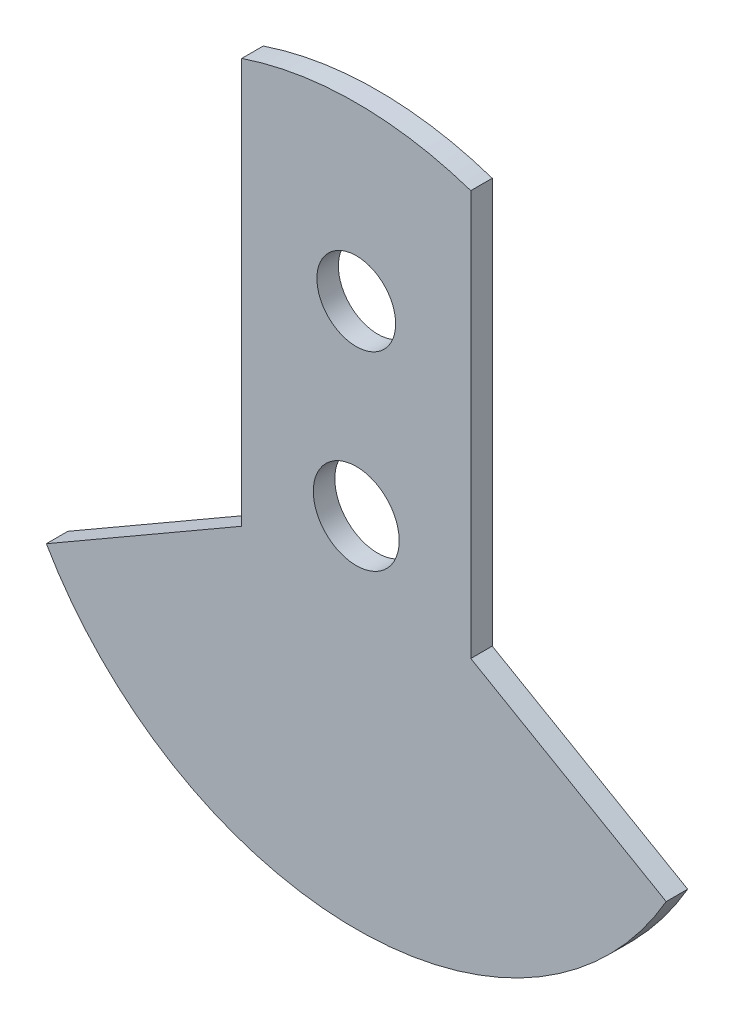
ISO-10303-21;
HEADER;
FILE_DESCRIPTION(('STEP AP214'),'2;1');
FILE_NAME('part.step','',(''),(''),'','','');
FILE_SCHEMA(('AUTOMOTIVE_DESIGN { 1 0 10303 214 1 1 1 1 }'));
ENDSEC;
DATA;
#1=APPLICATION_CONTEXT('core data for automotive mechanical design processes');
#2=APPLICATION_PROTOCOL_DEFINITION('international standard','automotive_design',2000,#1);
#3=PRODUCT_CONTEXT('',#1,'mechanical');
#4=PRODUCT('Part','Part','',(#3));
#5=PRODUCT_RELATED_PRODUCT_CATEGORY('part','',(#4));
#6=PRODUCT_DEFINITION_FORMATION('','',#4);
#7=PRODUCT_DEFINITION_CONTEXT('part definition',#1,'design');
#8=PRODUCT_DEFINITION('design','',#6,#7);
#9=PRODUCT_DEFINITION_SHAPE('','',#8);
#10=(LENGTH_UNIT() NAMED_UNIT(*) SI_UNIT(.MILLI.,.METRE.));
#11=(NAMED_UNIT(*) PLANE_ANGLE_UNIT() SI_UNIT($,.RADIAN.));
#12=(NAMED_UNIT(*) SI_UNIT($,.STERADIAN.) SOLID_ANGLE_UNIT());
#13=UNCERTAINTY_MEASURE_WITH_UNIT(LENGTH_MEASURE(1.E-05),#10,'distance_accuracy_value','');
#14=(GEOMETRIC_REPRESENTATION_CONTEXT(3) GLOBAL_UNCERTAINTY_ASSIGNED_CONTEXT((#13)) GLOBAL_UNIT_ASSIGNED_CONTEXT((#10,
#11,#12)) REPRESENTATION_CONTEXT('',''));
#15=CARTESIAN_POINT('',(0.,0.,0.));
#16=DIRECTION('',(0.,0.,1.));
#17=DIRECTION('',(1.,0.,0.));
#18=AXIS2_PLACEMENT_3D('',#15,#16,#17);
#19=CARTESIAN_POINT('',(0.,0.,1.5));
#20=DIRECTION('',(0.,0.,1.));
#21=DIRECTION('',(1.,0.,0.));
#22=AXIS2_PLACEMENT_3D('',#19,#20,#21);
#23=PLANE('',#22);
#24=CARTESIAN_POINT('',(0.,0.,1.5));
#25=DIRECTION('',(0.,0.,1.));
#26=DIRECTION('',(1.,0.,0.));
#27=AXIS2_PLACEMENT_3D('',#24,#25,#26);
#28=CIRCLE('',#27,3.);
#29=CARTESIAN_POINT('',(3.,0.,1.5));
#30=VERTEX_POINT('',#29);
#31=EDGE_CURVE('E102',#30,#30,#28,.T.);
#32=ORIENTED_EDGE('',*,*,#31,.F.);
#33=EDGE_LOOP('',(#32));
#34=FACE_BOUND('',#33,.T.);
#35=CARTESIAN_POINT('',(0.,0.,1.5));
#36=DIRECTION('',(0.,0.,1.));
#37=DIRECTION('',(1.,0.,0.));
#38=AXIS2_PLACEMENT_3D('',#35,#36,#37);
#39=CIRCLE('',#38,25.);
#40=CARTESIAN_POINT('',(-21.650635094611,-12.5,1.5));
#41=VERTEX_POINT('',#40);
#42=CARTESIAN_POINT('',(21.650635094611,-12.5,1.5));
#43=VERTEX_POINT('',#42);
#44=EDGE_CURVE('E116',#41,#43,#39,.T.);
#45=ORIENTED_EDGE('',*,*,#44,.T.);
#46=DIRECTION('',(-0.866025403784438,0.500000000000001,0.));
#47=VECTOR('',#46,1.);
#48=CARTESIAN_POINT('',(8.,-4.61880215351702,1.5));
#49=LINE('',#48,#47);
#50=CARTESIAN_POINT('',(8.,-4.61880215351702,1.5));
#51=VERTEX_POINT('',#50);
#52=EDGE_CURVE('E97',#43,#51,#49,.T.);
#53=ORIENTED_EDGE('',*,*,#52,.T.);
#54=DIRECTION('',(0.,1.,0.));
#55=VECTOR('',#54,1.);
#56=CARTESIAN_POINT('',(8.,-4.61880215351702,1.5));
#57=LINE('',#56,#55);
#58=CARTESIAN_POINT('',(8.,23.685438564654,1.5));
#59=VERTEX_POINT('',#58);
#60=EDGE_CURVE('E119',#51,#59,#57,.T.);
#61=ORIENTED_EDGE('',*,*,#60,.T.);
#62=CARTESIAN_POINT('',(0.,0.,1.5));
#63=DIRECTION('',(0.,0.,1.));
#64=DIRECTION('',(1.,0.,0.));
#65=AXIS2_PLACEMENT_3D('',#62,#63,#64);
#66=CIRCLE('',#65,25.);
#67=CARTESIAN_POINT('',(-8.,23.685438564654,1.5));
#68=VERTEX_POINT('',#67);
#69=EDGE_CURVE('E121',#59,#68,#66,.T.);
#70=ORIENTED_EDGE('',*,*,#69,.T.);
#71=DIRECTION('',(0.,-1.,0.));
#72=VECTOR('',#71,1.);
#73=CARTESIAN_POINT('',(-8.,-4.61880215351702,1.5));
#74=LINE('',#73,#72);
#75=CARTESIAN_POINT('',(-8.,-4.61880215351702,1.5));
#76=VERTEX_POINT('',#75);
#77=EDGE_CURVE('E50',#68,#76,#74,.T.);
#78=ORIENTED_EDGE('',*,*,#77,.T.);
#79=DIRECTION('',(-0.866025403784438,-0.500000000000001,0.));
#80=VECTOR('',#79,1.);
#81=CARTESIAN_POINT('',(-8.,-4.61880215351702,1.5));
#82=LINE('',#81,#80);
#83=EDGE_CURVE('E45',#76,#41,#82,.T.);
#84=ORIENTED_EDGE('',*,*,#83,.T.);
#85=EDGE_LOOP('',(#45,#53,#61,#70,#78,#84));
#86=FACE_BOUND('',#85,.T.);
#87=CARTESIAN_POINT('',(0.,13.,1.5));
#88=DIRECTION('',(0.,0.,1.));
#89=DIRECTION('',(1.,0.,0.));
#90=AXIS2_PLACEMENT_3D('',#87,#88,#89);
#91=CIRCLE('',#90,2.75);
#92=CARTESIAN_POINT('',(2.75,13.,1.5));
#93=VERTEX_POINT('',#92);
#94=EDGE_CURVE('E176',#93,#93,#91,.T.);
#95=ORIENTED_EDGE('',*,*,#94,.F.);
#96=EDGE_LOOP('',(#95));
#97=FACE_BOUND('',#96,.T.);
#98=ADVANCED_FACE('F30',(#34,#86,#97),#23,.T.);
#99=CARTESIAN_POINT('',(0.,0.,0.));
#100=DIRECTION('',(0.,0.,1.));
#101=DIRECTION('',(1.,0.,0.));
#102=AXIS2_PLACEMENT_3D('',#99,#100,#101);
#103=PLANE('',#102);
#104=CARTESIAN_POINT('',(0.,0.,0.));
#105=DIRECTION('',(0.,0.,1.));
#106=DIRECTION('',(1.,0.,0.));
#107=AXIS2_PLACEMENT_3D('',#104,#105,#106);
#108=CIRCLE('',#107,3.);
#109=CARTESIAN_POINT('',(3.,0.,0.));
#110=VERTEX_POINT('',#109);
#111=EDGE_CURVE('E105',#110,#110,#108,.T.);
#112=ORIENTED_EDGE('',*,*,#111,.T.);
#113=EDGE_LOOP('',(#112));
#114=FACE_BOUND('',#113,.T.);
#115=CARTESIAN_POINT('',(0.,0.,0.));
#116=DIRECTION('',(0.,0.,1.));
#117=DIRECTION('',(1.,0.,0.));
#118=AXIS2_PLACEMENT_3D('',#115,#116,#117);
#119=CIRCLE('',#118,25.);
#120=CARTESIAN_POINT('',(-21.650635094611,-12.5,0.));
#121=VERTEX_POINT('',#120);
#122=CARTESIAN_POINT('',(21.650635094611,-12.5,0.));
#123=VERTEX_POINT('',#122);
#124=EDGE_CURVE('E88',#121,#123,#119,.T.);
#125=ORIENTED_EDGE('',*,*,#124,.F.);
#126=DIRECTION('',(-0.866025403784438,-0.500000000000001,0.));
#127=VECTOR('',#126,1.);
#128=CARTESIAN_POINT('',(-8.,-4.61880215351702,0.));
#129=LINE('',#128,#127);
#130=CARTESIAN_POINT('',(-8.,-4.61880215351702,0.));
#131=VERTEX_POINT('',#130);
#132=EDGE_CURVE('E114',#131,#121,#129,.T.);
#133=ORIENTED_EDGE('',*,*,#132,.F.);
#134=DIRECTION('',(0.,-1.,0.));
#135=VECTOR('',#134,1.);
#136=CARTESIAN_POINT('',(-8.,-4.61880215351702,0.));
#137=LINE('',#136,#135);
#138=CARTESIAN_POINT('',(-8.,23.685438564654,0.));
#139=VERTEX_POINT('',#138);
#140=EDGE_CURVE('E112',#139,#131,#137,.T.);
#141=ORIENTED_EDGE('',*,*,#140,.F.);
#142=CARTESIAN_POINT('',(0.,0.,0.));
#143=DIRECTION('',(0.,0.,1.));
#144=DIRECTION('',(1.,0.,0.));
#145=AXIS2_PLACEMENT_3D('',#142,#143,#144);
#146=CIRCLE('',#145,25.);
#147=CARTESIAN_POINT('',(8.,23.685438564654,0.));
#148=VERTEX_POINT('',#147);
#149=EDGE_CURVE('E110',#148,#139,#146,.T.);
#150=ORIENTED_EDGE('',*,*,#149,.F.);
#151=DIRECTION('',(0.,1.,0.));
#152=VECTOR('',#151,1.);
#153=CARTESIAN_POINT('',(8.,-4.61880215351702,0.));
#154=LINE('',#153,#152);
#155=CARTESIAN_POINT('',(8.,-4.61880215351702,0.));
#156=VERTEX_POINT('',#155);
#157=EDGE_CURVE('E90',#156,#148,#154,.T.);
#158=ORIENTED_EDGE('',*,*,#157,.F.);
#159=DIRECTION('',(-0.866025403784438,0.500000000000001,0.));
#160=VECTOR('',#159,1.);
#161=CARTESIAN_POINT('',(8.,-4.61880215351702,0.));
#162=LINE('',#161,#160);
#163=EDGE_CURVE('E83',#123,#156,#162,.T.);
#164=ORIENTED_EDGE('',*,*,#163,.F.);
#165=EDGE_LOOP('',(#125,#133,#141,#150,#158,#164));
#166=FACE_BOUND('',#165,.T.);
#167=CARTESIAN_POINT('',(0.,13.,0.));
#168=DIRECTION('',(0.,0.,1.));
#169=DIRECTION('',(1.,0.,0.));
#170=AXIS2_PLACEMENT_3D('',#167,#168,#169);
#171=CIRCLE('',#170,2.75);
#172=CARTESIAN_POINT('',(2.75,13.,0.));
#173=VERTEX_POINT('',#172);
#174=EDGE_CURVE('E179',#173,#173,#171,.T.);
#175=ORIENTED_EDGE('',*,*,#174,.T.);
#176=EDGE_LOOP('',(#175));
#177=FACE_BOUND('',#176,.T.);
#178=ADVANCED_FACE('F84',(#114,#166,#177),#103,.F.);
#179=CARTESIAN_POINT('',(0.,0.,1.5));
#180=DIRECTION('',(0.,0.,-1.));
#181=DIRECTION('',(-1.,0.,0.));
#182=AXIS2_PLACEMENT_3D('',#179,#180,#181);
#183=CYLINDRICAL_SURFACE('',#182,25.);
#184=ORIENTED_EDGE('',*,*,#124,.T.);
#185=DIRECTION('',(0.,0.,-1.));
#186=VECTOR('',#185,1.);
#187=CARTESIAN_POINT('',(21.650635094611,-12.5,1.5));
#188=LINE('',#187,#186);
#189=EDGE_CURVE('E11',#43,#123,#188,.T.);
#190=ORIENTED_EDGE('',*,*,#189,.F.);
#191=ORIENTED_EDGE('',*,*,#44,.F.);
#192=DIRECTION('',(0.,0.,-1.));
#193=VECTOR('',#192,1.);
#194=CARTESIAN_POINT('',(-21.650635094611,-12.5,1.5));
#195=LINE('',#194,#193);
#196=EDGE_CURVE('E101',#41,#121,#195,.T.);
#197=ORIENTED_EDGE('',*,*,#196,.T.);
#198=EDGE_LOOP('',(#184,#190,#191,#197));
#199=FACE_BOUND('',#198,.T.);
#200=ADVANCED_FACE('F32',(#199),#183,.T.);
#201=CARTESIAN_POINT('',(8.,-4.61880215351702,1.5));
#202=DIRECTION('',(-0.500000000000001,-0.866025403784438,0.));
#203=DIRECTION('',(0.866025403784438,-0.500000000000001,0.));
#204=AXIS2_PLACEMENT_3D('',#201,#202,#203);
#205=PLANE('',#204);
#206=ORIENTED_EDGE('',*,*,#163,.T.);
#207=DIRECTION('',(0.,0.,-1.));
#208=VECTOR('',#207,1.);
#209=CARTESIAN_POINT('',(8.,-4.61880215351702,1.5));
#210=LINE('',#209,#208);
#211=EDGE_CURVE('E38',#51,#156,#210,.T.);
#212=ORIENTED_EDGE('',*,*,#211,.F.);
#213=ORIENTED_EDGE('',*,*,#52,.F.);
#214=ORIENTED_EDGE('',*,*,#189,.T.);
#215=EDGE_LOOP('',(#206,#212,#213,#214));
#216=FACE_BOUND('',#215,.T.);
#217=ADVANCED_FACE('F96',(#216),#205,.F.);
#218=CARTESIAN_POINT('',(8.,-4.61880215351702,1.5));
#219=DIRECTION('',(-1.,0.,0.));
#220=DIRECTION('',(0.,0.,1.));
#221=AXIS2_PLACEMENT_3D('',#218,#219,#220);
#222=PLANE('',#221);
#223=ORIENTED_EDGE('',*,*,#157,.T.);
#224=DIRECTION('',(0.,0.,-1.));
#225=VECTOR('',#224,1.);
#226=CARTESIAN_POINT('',(8.,23.685438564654,1.5));
#227=LINE('',#226,#225);
#228=EDGE_CURVE('E132',#59,#148,#227,.T.);
#229=ORIENTED_EDGE('',*,*,#228,.F.);
#230=ORIENTED_EDGE('',*,*,#60,.F.);
#231=ORIENTED_EDGE('',*,*,#211,.T.);
#232=EDGE_LOOP('',(#223,#229,#230,#231));
#233=FACE_BOUND('',#232,.T.);
#234=ADVANCED_FACE('F136',(#233),#222,.F.);
#235=CARTESIAN_POINT('',(0.,0.,1.5));
#236=DIRECTION('',(0.,0.,-1.));
#237=DIRECTION('',(-1.,0.,0.));
#238=AXIS2_PLACEMENT_3D('',#235,#236,#237);
#239=CYLINDRICAL_SURFACE('',#238,25.);
#240=ORIENTED_EDGE('',*,*,#149,.T.);
#241=DIRECTION('',(0.,0.,-1.));
#242=VECTOR('',#241,1.);
#243=CARTESIAN_POINT('',(-8.,23.685438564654,1.5));
#244=LINE('',#243,#242);
#245=EDGE_CURVE('E129',#68,#139,#244,.T.);
#246=ORIENTED_EDGE('',*,*,#245,.F.);
#247=ORIENTED_EDGE('',*,*,#69,.F.);
#248=ORIENTED_EDGE('',*,*,#228,.T.);
#249=EDGE_LOOP('',(#240,#246,#247,#248));
#250=FACE_BOUND('',#249,.T.);
#251=ADVANCED_FACE('F142',(#250),#239,.T.);
#252=CARTESIAN_POINT('',(-8.,-4.61880215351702,1.5));
#253=DIRECTION('',(1.,0.,0.));
#254=DIRECTION('',(0.,0.,-1.));
#255=AXIS2_PLACEMENT_3D('',#252,#253,#254);
#256=PLANE('',#255);
#257=ORIENTED_EDGE('',*,*,#140,.T.);
#258=DIRECTION('',(0.,0.,-1.));
#259=VECTOR('',#258,1.);
#260=CARTESIAN_POINT('',(-8.,-4.61880215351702,1.5));
#261=LINE('',#260,#259);
#262=EDGE_CURVE('E126',#76,#131,#261,.T.);
#263=ORIENTED_EDGE('',*,*,#262,.F.);
#264=ORIENTED_EDGE('',*,*,#77,.F.);
#265=ORIENTED_EDGE('',*,*,#245,.T.);
#266=EDGE_LOOP('',(#257,#263,#264,#265));
#267=FACE_BOUND('',#266,.T.);
#268=ADVANCED_FACE('F145',(#267),#256,.F.);
#269=CARTESIAN_POINT('',(-8.,-4.61880215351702,1.5));
#270=DIRECTION('',(0.500000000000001,-0.866025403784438,0.));
#271=DIRECTION('',(0.866025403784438,0.500000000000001,0.));
#272=AXIS2_PLACEMENT_3D('',#269,#270,#271);
#273=PLANE('',#272);
#274=ORIENTED_EDGE('',*,*,#132,.T.);
#275=ORIENTED_EDGE('',*,*,#196,.F.);
#276=ORIENTED_EDGE('',*,*,#83,.F.);
#277=ORIENTED_EDGE('',*,*,#262,.T.);
#278=EDGE_LOOP('',(#274,#275,#276,#277));
#279=FACE_BOUND('',#278,.T.);
#280=ADVANCED_FACE('F147',(#279),#273,.F.);
#281=CARTESIAN_POINT('',(0.,0.,1.5));
#282=DIRECTION('',(0.,0.,-1.));
#283=DIRECTION('',(-1.,0.,0.));
#284=AXIS2_PLACEMENT_3D('',#281,#282,#283);
#285=CYLINDRICAL_SURFACE('',#284,3.);
#286=ORIENTED_EDGE('',*,*,#31,.T.);
#287=EDGE_LOOP('',(#286));
#288=FACE_BOUND('',#287,.T.);
#289=ORIENTED_EDGE('',*,*,#111,.F.);
#290=EDGE_LOOP('',(#289));
#291=FACE_BOUND('',#290,.T.);
#292=ADVANCED_FACE('F149',(#288,#291),#285,.F.);
#293=CARTESIAN_POINT('',(0.,13.,1.5));
#294=DIRECTION('',(0.,0.,-1.));
#295=DIRECTION('',(-1.,0.,0.));
#296=AXIS2_PLACEMENT_3D('',#293,#294,#295);
#297=CYLINDRICAL_SURFACE('',#296,2.75);
#298=ORIENTED_EDGE('',*,*,#94,.T.);
#299=EDGE_LOOP('',(#298));
#300=FACE_BOUND('',#299,.T.);
#301=ORIENTED_EDGE('',*,*,#174,.F.);
#302=EDGE_LOOP('',(#301));
#303=FACE_BOUND('',#302,.T.);
#304=ADVANCED_FACE('F155',(#300,#303),#297,.F.);
#305=CLOSED_SHELL('',(#98,#178,#200,#217,#234,#251,#268,#280,#292,#304));
#306=MANIFOLD_SOLID_BREP('B2',#305);
#307=ADVANCED_BREP_SHAPE_REPRESENTATION('',(#18,#306),#14);
#308=SHAPE_DEFINITION_REPRESENTATION(#9,#307);
ENDSEC;
END-ISO-10303-21;
